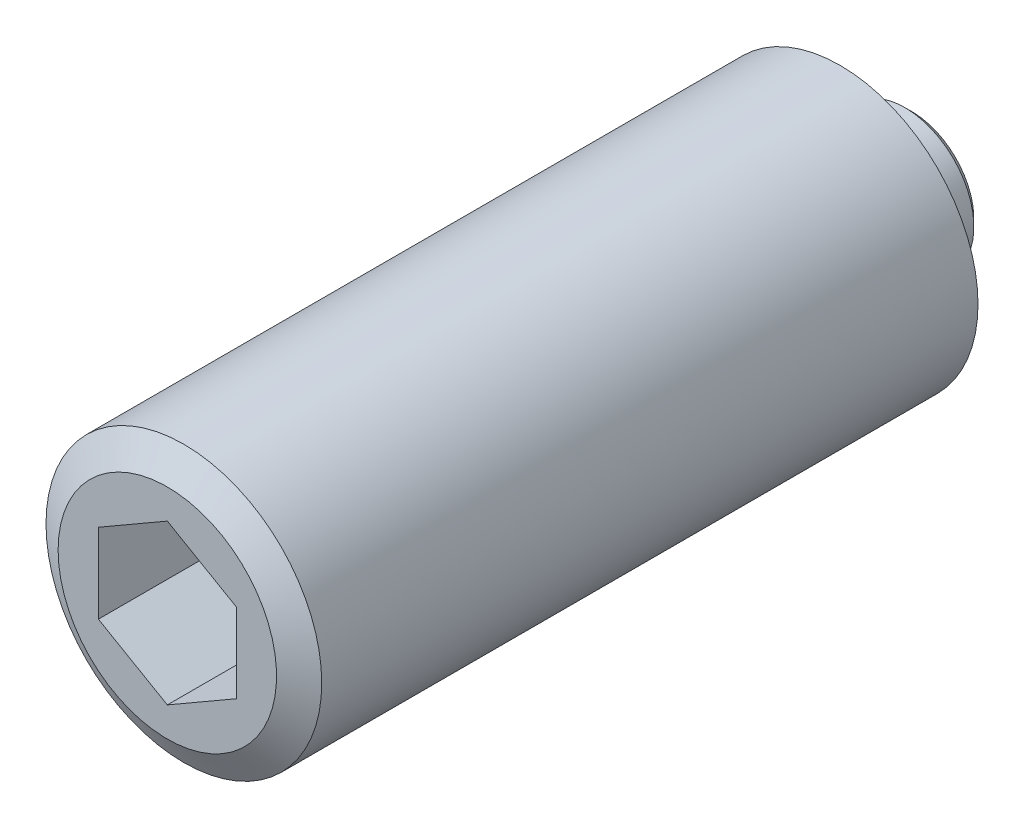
ISO-10303-21;
HEADER;
FILE_DESCRIPTION(('STEP AP214'),'2;1');
FILE_NAME('part.step','',(''),(''),'','','');
FILE_SCHEMA(('AUTOMOTIVE_DESIGN { 1 0 10303 214 1 1 1 1 }'));
ENDSEC;
DATA;
#1=APPLICATION_CONTEXT('core data for automotive mechanical design processes');
#2=APPLICATION_PROTOCOL_DEFINITION('international standard','automotive_design',2000,#1);
#3=PRODUCT_CONTEXT('',#1,'mechanical');
#4=PRODUCT('Part','Part','',(#3));
#5=PRODUCT_RELATED_PRODUCT_CATEGORY('part','',(#4));
#6=PRODUCT_DEFINITION_FORMATION('','',#4);
#7=PRODUCT_DEFINITION_CONTEXT('part definition',#1,'design');
#8=PRODUCT_DEFINITION('design','',#6,#7);
#9=PRODUCT_DEFINITION_SHAPE('','',#8);
#10=(LENGTH_UNIT() NAMED_UNIT(*) SI_UNIT(.MILLI.,.METRE.));
#11=(NAMED_UNIT(*) PLANE_ANGLE_UNIT() SI_UNIT($,.RADIAN.));
#12=(NAMED_UNIT(*) SI_UNIT($,.STERADIAN.) SOLID_ANGLE_UNIT());
#13=UNCERTAINTY_MEASURE_WITH_UNIT(LENGTH_MEASURE(1.E-05),#10,'distance_accuracy_value','');
#14=(GEOMETRIC_REPRESENTATION_CONTEXT(3) GLOBAL_UNCERTAINTY_ASSIGNED_CONTEXT((#13)) GLOBAL_UNIT_ASSIGNED_CONTEXT((#10,
#11,#12)) REPRESENTATION_CONTEXT('',''));
#15=CARTESIAN_POINT('',(0.,0.,0.));
#16=DIRECTION('',(0.,0.,1.));
#17=DIRECTION('',(1.,0.,0.));
#18=AXIS2_PLACEMENT_3D('',#15,#16,#17);
#19=CARTESIAN_POINT('',(0.,0.,0.));
#20=DIRECTION('',(0.,0.,-1.));
#21=DIRECTION('',(-1.,0.,0.));
#22=AXIS2_PLACEMENT_3D('',#19,#20,#21);
#23=PLANE('',#22);
#24=CARTESIAN_POINT('',(0.,0.,0.));
#25=DIRECTION('',(0.,0.,-1.));
#26=DIRECTION('',(-1.,0.,0.));
#27=AXIS2_PLACEMENT_3D('',#24,#25,#26);
#28=CIRCLE('',#27,4.5);
#29=CARTESIAN_POINT('',(-4.5,0.,0.));
#30=VERTEX_POINT('',#29);
#31=EDGE_CURVE('E9',#30,#30,#28,.T.);
#32=ORIENTED_EDGE('',*,*,#31,.T.);
#33=EDGE_LOOP('',(#32));
#34=FACE_BOUND('',#33,.T.);
#35=ADVANCED_FACE('F14',(#34),#23,.T.);
#36=CARTESIAN_POINT('',(0.,0.,0.));
#37=DIRECTION('',(0.,0.,1.));
#38=DIRECTION('',(1.,0.,0.));
#39=AXIS2_PLACEMENT_3D('',#36,#37,#38);
#40=CONICAL_SURFACE('',#39,4.5,0.785398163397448);
#41=CARTESIAN_POINT('',(0.,0.,0.5));
#42=DIRECTION('',(0.,0.,-1.));
#43=DIRECTION('',(-1.,0.,0.));
#44=AXIS2_PLACEMENT_3D('',#41,#42,#43);
#45=CIRCLE('',#44,5.);
#46=CARTESIAN_POINT('',(-5.,0.,0.5));
#47=VERTEX_POINT('',#46);
#48=EDGE_CURVE('E21',#47,#47,#45,.T.);
#49=ORIENTED_EDGE('',*,*,#48,.T.);
#50=EDGE_LOOP('',(#49));
#51=FACE_BOUND('',#50,.T.);
#52=ORIENTED_EDGE('',*,*,#31,.F.);
#53=EDGE_LOOP('',(#52));
#54=FACE_BOUND('',#53,.T.);
#55=ADVANCED_FACE('F143',(#51,#54),#40,.T.);
#56=CARTESIAN_POINT('',(0.,0.,-3.0000000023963));
#57=DIRECTION('',(0.,0.,-1.));
#58=DIRECTION('',(-1.,0.,0.));
#59=AXIS2_PLACEMENT_3D('',#56,#57,#58);
#60=CYLINDRICAL_SURFACE('',#59,5.);
#61=CARTESIAN_POINT('',(0.,0.,2.5));
#62=DIRECTION('',(0.,0.,-1.));
#63=DIRECTION('',(-1.,0.,0.));
#64=AXIS2_PLACEMENT_3D('',#61,#62,#63);
#65=CIRCLE('',#64,5.);
#66=CARTESIAN_POINT('',(-5.,0.,2.5));
#67=VERTEX_POINT('',#66);
#68=EDGE_CURVE('E138',#67,#67,#65,.T.);
#69=ORIENTED_EDGE('',*,*,#68,.T.);
#70=EDGE_LOOP('',(#69));
#71=FACE_BOUND('',#70,.T.);
#72=ORIENTED_EDGE('',*,*,#48,.F.);
#73=EDGE_LOOP('',(#72));
#74=FACE_BOUND('',#73,.T.);
#75=ADVANCED_FACE('F146',(#71,#74),#60,.T.);
#76=CARTESIAN_POINT('',(0.,5.19999997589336,2.5));
#77=DIRECTION('',(0.,0.,-1.));
#78=DIRECTION('',(-1.,0.,0.));
#79=AXIS2_PLACEMENT_3D('',#76,#77,#78);
#80=PLANE('',#79);
#81=CARTESIAN_POINT('',(0.,0.,2.5));
#82=DIRECTION('',(0.,0.,-1.));
#83=DIRECTION('',(-1.,0.,0.));
#84=AXIS2_PLACEMENT_3D('',#81,#82,#83);
#85=CIRCLE('',#84,5.19999997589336);
#86=CARTESIAN_POINT('',(0.,5.19999997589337,2.5));
#87=VERTEX_POINT('',#86);
#88=EDGE_CURVE('E135',#87,#87,#85,.T.);
#89=ORIENTED_EDGE('',*,*,#88,.T.);
#90=EDGE_LOOP('',(#89));
#91=FACE_BOUND('',#90,.T.);
#92=ORIENTED_EDGE('',*,*,#68,.F.);
#93=EDGE_LOOP('',(#92));
#94=FACE_BOUND('',#93,.T.);
#95=ADVANCED_FACE('F148',(#91,#94),#80,.T.);
#96=CARTESIAN_POINT('',(0.,0.,6.4));
#97=DIRECTION('',(0.,0.,-1.));
#98=DIRECTION('',(0.,1.,0.));
#99=AXIS2_PLACEMENT_3D('',#96,#97,#98);
#100=SPHERICAL_SURFACE('',#99,6.4999999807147);
#101=CARTESIAN_POINT('',(0.,0.,3.9999999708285));
#102=DIRECTION('',(0.,0.,-1.));
#103=DIRECTION('',(-1.,0.,0.));
#104=AXIS2_PLACEMENT_3D('',#101,#102,#103);
#105=CIRCLE('',#104,6.04069529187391);
#106=CARTESIAN_POINT('',(0.,6.04069529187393,3.9999999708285));
#107=VERTEX_POINT('',#106);
#108=EDGE_CURVE('E132',#107,#107,#105,.T.);
#109=CARTESIAN_POINT('',(0.,6.04069529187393,3.9999999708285));
#110=CARTESIAN_POINT('',(0.,6.0340622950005,3.9833050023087));
#111=CARTESIAN_POINT('',(0.,6.02736008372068,3.96663753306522));
#112=CARTESIAN_POINT('',(0.,6.01381770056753,3.93335873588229));
#113=CARTESIAN_POINT('',(0.,6.00697752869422,3.91674740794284));
#114=CARTESIAN_POINT('',(0.,5.99315969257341,3.88358203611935));
#115=CARTESIAN_POINT('',(0.,5.98618202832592,3.86702799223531));
#116=CARTESIAN_POINT('',(0.,5.97208968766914,3.83397832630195));
#117=CARTESIAN_POINT('',(0.,5.96497501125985,3.81748270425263));
#118=CARTESIAN_POINT('',(0.,5.95060913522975,3.78455101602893));
#119=CARTESIAN_POINT('',(0.,5.94335793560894,3.76811494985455));
#120=CARTESIAN_POINT('',(0.,5.92871951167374,3.73530350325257));
#121=CARTESIAN_POINT('',(0.,5.92133228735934,3.71892812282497));
#122=CARTESIAN_POINT('',(0.,5.90642232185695,3.68623917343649));
#123=CARTESIAN_POINT('',(0.,5.89889958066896,3.66992560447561));
#124=CARTESIAN_POINT('',(0.,5.88371909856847,3.63736139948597));
#125=CARTESIAN_POINT('',(0.,5.87606135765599,3.62111076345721));
#126=CARTESIAN_POINT('',(0.,5.86061140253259,3.58867354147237));
#127=CARTESIAN_POINT('',(0.,5.85281918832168,3.57248695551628));
#128=CARTESIAN_POINT('',(0.,5.83710082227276,3.54017894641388));
#129=CARTESIAN_POINT('',(0.,5.82917467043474,3.52405752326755));
#130=CARTESIAN_POINT('',(0.,5.81318897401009,3.49188094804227));
#131=CARTESIAN_POINT('',(0.,5.80512942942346,3.47582579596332));
#132=CARTESIAN_POINT('',(0.,5.78887750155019,3.44378286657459));
#133=CARTESIAN_POINT('',(0.,5.78068511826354,3.42779508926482));
#134=CARTESIAN_POINT('',(0.,5.76416807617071,3.39588800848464));
#135=CARTESIAN_POINT('',(0.,5.75584341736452,3.37996870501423));
#136=CARTESIAN_POINT('',(0.,5.7390623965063,3.34819966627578));
#137=CARTESIAN_POINT('',(0.,5.73060603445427,3.33234993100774));
#138=CARTESIAN_POINT('',(0.,5.7135621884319,3.30072111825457));
#139=CARTESIAN_POINT('',(0.,5.70497470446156,3.28494204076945));
#140=CARTESIAN_POINT('',(0.,5.68766920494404,3.25345562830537));
#141=CARTESIAN_POINT('',(0.,5.67895118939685,3.23774829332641));
#142=CARTESIAN_POINT('',(0.,5.66138522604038,3.206406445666));
#143=CARTESIAN_POINT('',(0.,5.6525372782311,3.19077193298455));
#144=CARTESIAN_POINT('',(0.,5.63471205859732,3.15957680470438));
#145=CARTESIAN_POINT('',(0.,5.62573478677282,3.14401618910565));
#146=CARTESIAN_POINT('',(0.,5.60765153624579,3.11296992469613));
#147=CARTESIAN_POINT('',(0.,5.59854555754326,3.09748427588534));
#148=CARTESIAN_POINT('',(0.,5.58020551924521,3.06658900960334));
#149=CARTESIAN_POINT('',(0.,5.5709714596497,3.05117939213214));
#150=CARTESIAN_POINT('',(0.,5.55237589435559,3.02043724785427));
#151=CARTESIAN_POINT('',(0.,5.543014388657,3.00510472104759));
#152=CARTESIAN_POINT('',(0.,5.52416457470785,2.97451781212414));
#153=CARTESIAN_POINT('',(0.,5.51467626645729,2.95926343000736));
#154=CARTESIAN_POINT('',(0.,5.49557349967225,2.9288338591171));
#155=CARTESIAN_POINT('',(0.,5.48595904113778,2.9136586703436));
#156=CARTESIAN_POINT('',(0.,5.46660463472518,2.88338852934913));
#157=CARTESIAN_POINT('',(0.,5.45686468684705,2.86829357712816));
#158=CARTESIAN_POINT('',(0.,5.43725997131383,2.83818494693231));
#159=CARTESIAN_POINT('',(0.,5.42739520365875,2.82317126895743));
#160=CARTESIAN_POINT('',(0.,5.40754152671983,2.79322621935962));
#161=CARTESIAN_POINT('',(0.,5.39755261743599,2.77829484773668));
#162=CARTESIAN_POINT('',(0.,5.37745134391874,2.74851543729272));
#163=CARTESIAN_POINT('',(0.,5.36733897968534,2.7336673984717));
#164=CARTESIAN_POINT('',(0.,5.34699149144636,2.70405567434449));
#165=CARTESIAN_POINT('',(0.,5.33675636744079,2.68929198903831));
#166=CARTESIAN_POINT('',(0.,5.31616406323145,2.65984998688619));
#167=CARTESIAN_POINT('',(0.,5.30580688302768,2.64517167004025));
#168=CARTESIAN_POINT('',(0.,5.28497117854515,2.61590141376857));
#169=CARTESIAN_POINT('',(0.,5.2744926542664,2.60130947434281));
#170=CARTESIAN_POINT('',(0.,5.25341498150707,2.57221297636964));
#171=CARTESIAN_POINT('',(0.,5.24281583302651,2.55770841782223));
#172=CARTESIAN_POINT('',(0.,5.22149764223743,2.52878767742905));
#173=CARTESIAN_POINT('',(0.,5.21077859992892,2.51437149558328));
#174=CARTESIAN_POINT('',(0.,5.19999997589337,2.5));
#175=B_SPLINE_CURVE_WITH_KNOTS('',3,(#109,#110,#111,#112,#113,#114,#115,#116,#117,#118,#119,
#120,#121,#122,#123,#124,#125,#126,#127,#128,#129,#130,#131,#132,#133,#134,#135,#136,#137,#138,
#139,#140,#141,#142,#143,#144,#145,#146,#147,#148,#149,#150,#151,#152,#153,#154,#155,#156,#157,
#158,#159,#160,#161,#162,#163,#164,#165,#166,#167,#168,#169,#170,#171,#172,#173,#174),
.UNSPECIFIED.,.F.,.F.,(4,2,2,2,2,2,2,2,2,2,2,2,2,2,2,2,2,2,2,2,2,2,2,2,2,2,2,2,2,2,2,2,4),(0.,
0.0538929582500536,0.107785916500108,0.161678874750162,0.215571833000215,0.26946479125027,
0.323357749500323,0.377250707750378,0.431143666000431,0.485036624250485,0.538929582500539,
0.592822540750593,0.646715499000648,0.700608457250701,0.754501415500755,0.808394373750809,
0.862287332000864,0.916180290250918,0.970073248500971,1.02396620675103,1.07785916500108,
1.13175212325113,1.18564508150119,1.23953803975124,1.2934309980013,1.34732395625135,
1.4012169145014,1.45510987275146,1.50900283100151,1.56289578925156,1.61678874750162,
1.67068170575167,1.72457466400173),.UNSPECIFIED.);
#176=EDGE_CURVE('BSEAM157',#107,#87,#175,.T.);
#177=ORIENTED_EDGE('',*,*,#108,.T.);
#178=ORIENTED_EDGE('',*,*,#88,.F.);
#179=ORIENTED_EDGE('',*,*,#176,.T.);
#180=ORIENTED_EDGE('',*,*,#176,.F.);
#181=EDGE_LOOP('',(#177,#179,#178,#180));
#182=FACE_BOUND('',#181,.T.);
#183=ADVANCED_FACE('F157',(#182),#100,.T.);
#184=CARTESIAN_POINT('',(0.,7.92153901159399,3.9999999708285));
#185=DIRECTION('',(0.,0.,-1.));
#186=DIRECTION('',(-1.,0.,0.));
#187=AXIS2_PLACEMENT_3D('',#184,#185,#186);
#188=PLANE('',#187);
#189=CARTESIAN_POINT('',(0.,0.,3.9999999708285));
#190=DIRECTION('',(0.,0.,-1.));
#191=DIRECTION('',(-1.,0.,0.));
#192=AXIS2_PLACEMENT_3D('',#189,#190,#191);
#193=CIRCLE('',#192,7.92153901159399);
#194=CARTESIAN_POINT('',(-7.92153901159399,0.,3.9999999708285));
#195=VERTEX_POINT('',#194);
#196=EDGE_CURVE('E129',#195,#195,#193,.T.);
#197=ORIENTED_EDGE('',*,*,#196,.T.);
#198=EDGE_LOOP('',(#197));
#199=FACE_BOUND('',#198,.T.);
#200=ORIENTED_EDGE('',*,*,#108,.F.);
#201=EDGE_LOOP('',(#200));
#202=FACE_BOUND('',#201,.T.);
#203=ADVANCED_FACE('F196',(#199,#202),#188,.T.);
#204=CARTESIAN_POINT('',(0.,0.,3.9999999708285));
#205=DIRECTION('',(0.,0.,1.));
#206=DIRECTION('',(1.,0.,0.));
#207=AXIS2_PLACEMENT_3D('',#204,#205,#206);
#208=CONICAL_SURFACE('',#207,7.92153901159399,1.0471975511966);
#209=CARTESIAN_POINT('',(0.,0.,5.1999999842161));
#210=DIRECTION('',(0.,0.,-1.));
#211=DIRECTION('',(-1.,0.,0.));
#212=AXIS2_PLACEMENT_3D('',#209,#210,#211);
#213=CIRCLE('',#212,10.0000000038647);
#214=CARTESIAN_POINT('',(-10.0000000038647,0.,5.1999999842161));
#215=VERTEX_POINT('',#214);
#216=EDGE_CURVE('E126',#215,#215,#213,.T.);
#217=ORIENTED_EDGE('',*,*,#216,.T.);
#218=EDGE_LOOP('',(#217));
#219=FACE_BOUND('',#218,.T.);
#220=ORIENTED_EDGE('',*,*,#196,.F.);
#221=EDGE_LOOP('',(#220));
#222=FACE_BOUND('',#221,.T.);
#223=ADVANCED_FACE('F204',(#219,#222),#208,.T.);
#224=CARTESIAN_POINT('',(0.,0.,-3.0000000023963));
#225=DIRECTION('',(0.,0.,-1.));
#226=DIRECTION('',(-1.,0.,0.));
#227=AXIS2_PLACEMENT_3D('',#224,#225,#226);
#228=CYLINDRICAL_SURFACE('',#227,10.0000000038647);
#229=CARTESIAN_POINT('',(0.,0.,52.7999999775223));
#230=DIRECTION('',(0.,0.,-1.));
#231=DIRECTION('',(-1.,0.,0.));
#232=AXIS2_PLACEMENT_3D('',#229,#230,#231);
#233=CIRCLE('',#232,10.0000000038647);
#234=CARTESIAN_POINT('',(-10.0000000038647,0.,52.7999999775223));
#235=VERTEX_POINT('',#234);
#236=EDGE_CURVE('E123',#235,#235,#233,.T.);
#237=ORIENTED_EDGE('',*,*,#236,.T.);
#238=EDGE_LOOP('',(#237));
#239=FACE_BOUND('',#238,.T.);
#240=ORIENTED_EDGE('',*,*,#216,.F.);
#241=EDGE_LOOP('',(#240));
#242=FACE_BOUND('',#241,.T.);
#243=ADVANCED_FACE('F213',(#239,#242),#228,.T.);
#244=CARTESIAN_POINT('',(0.,0.,52.7999999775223));
#245=DIRECTION('',(0.,0.,-1.));
#246=DIRECTION('',(-1.,0.,0.));
#247=AXIS2_PLACEMENT_3D('',#244,#245,#246);
#248=CONICAL_SURFACE('',#247,10.0000000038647,1.0471975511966);
#249=CARTESIAN_POINT('',(0.,0.,53.9999999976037));
#250=DIRECTION('',(0.,0.,-1.));
#251=DIRECTION('',(-1.,0.,0.));
#252=AXIS2_PLACEMENT_3D('',#249,#250,#251);
#253=CIRCLE('',#252,7.921539);
#254=CARTESIAN_POINT('',(-7.921539,0.,53.9999999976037));
#255=VERTEX_POINT('',#254);
#256=EDGE_CURVE('E115',#255,#255,#253,.T.);
#257=ORIENTED_EDGE('',*,*,#256,.T.);
#258=EDGE_LOOP('',(#257));
#259=FACE_BOUND('',#258,.T.);
#260=ORIENTED_EDGE('',*,*,#236,.F.);
#261=EDGE_LOOP('',(#260));
#262=FACE_BOUND('',#261,.T.);
#263=ADVANCED_FACE('F222',(#259,#262),#248,.T.);
#264=CARTESIAN_POINT('',(0.,7.921539,53.9999999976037));
#265=DIRECTION('',(0.,0.,1.));
#266=DIRECTION('',(1.,0.,0.));
#267=AXIS2_PLACEMENT_3D('',#264,#265,#266);
#268=PLANE('',#267);
#269=DIRECTION('',(-0.866025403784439,0.5,0.));
#270=VECTOR('',#269,1.);
#271=CARTESIAN_POINT('',(5.,2.88675134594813,53.9999999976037));
#272=LINE('',#271,#270);
#273=CARTESIAN_POINT('',(5.,2.88675134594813,53.9999999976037));
#274=VERTEX_POINT('',#273);
#275=CARTESIAN_POINT('',(0.,5.77350269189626,53.9999999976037));
#276=VERTEX_POINT('',#275);
#277=EDGE_CURVE('E28',#274,#276,#272,.T.);
#278=ORIENTED_EDGE('',*,*,#277,.F.);
#279=DIRECTION('',(0.,1.,0.));
#280=VECTOR('',#279,1.);
#281=CARTESIAN_POINT('',(5.,-2.88675134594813,53.9999999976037));
#282=LINE('',#281,#280);
#283=CARTESIAN_POINT('',(5.,-2.88675134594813,53.9999999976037));
#284=VERTEX_POINT('',#283);
#285=EDGE_CURVE('E111',#284,#274,#282,.T.);
#286=ORIENTED_EDGE('',*,*,#285,.F.);
#287=DIRECTION('',(0.866025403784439,0.5,0.));
#288=VECTOR('',#287,1.);
#289=CARTESIAN_POINT('',(0.,-5.77350269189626,53.9999999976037));
#290=LINE('',#289,#288);
#291=CARTESIAN_POINT('',(0.,-5.77350269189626,53.9999999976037));
#292=VERTEX_POINT('',#291);
#293=EDGE_CURVE('E109',#292,#284,#290,.T.);
#294=ORIENTED_EDGE('',*,*,#293,.F.);
#295=DIRECTION('',(0.866025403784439,-0.5,0.));
#296=VECTOR('',#295,1.);
#297=CARTESIAN_POINT('',(-5.,-2.88675134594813,53.9999999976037));
#298=LINE('',#297,#296);
#299=CARTESIAN_POINT('',(-5.,-2.88675134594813,53.9999999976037));
#300=VERTEX_POINT('',#299);
#301=EDGE_CURVE('E76',#300,#292,#298,.T.);
#302=ORIENTED_EDGE('',*,*,#301,.F.);
#303=DIRECTION('',(0.,-1.,0.));
#304=VECTOR('',#303,1.);
#305=CARTESIAN_POINT('',(-5.,2.88675134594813,53.9999999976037));
#306=LINE('',#305,#304);
#307=CARTESIAN_POINT('',(-5.,2.88675134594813,53.9999999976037));
#308=VERTEX_POINT('',#307);
#309=EDGE_CURVE('E105',#308,#300,#306,.T.);
#310=ORIENTED_EDGE('',*,*,#309,.F.);
#311=DIRECTION('',(-0.866025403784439,-0.5,0.));
#312=VECTOR('',#311,1.);
#313=CARTESIAN_POINT('',(0.,5.77350269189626,53.9999999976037));
#314=LINE('',#313,#312);
#315=EDGE_CURVE('E102',#276,#308,#314,.T.);
#316=ORIENTED_EDGE('',*,*,#315,.F.);
#317=EDGE_LOOP('',(#278,#286,#294,#302,#310,#316));
#318=FACE_BOUND('',#317,.T.);
#319=ORIENTED_EDGE('',*,*,#256,.F.);
#320=EDGE_LOOP('',(#319));
#321=FACE_BOUND('',#320,.T.);
#322=ADVANCED_FACE('F231',(#318,#321),#268,.T.);
#323=CARTESIAN_POINT('',(5.,2.88675134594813,45.9999999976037));
#324=DIRECTION('',(0.5,0.866025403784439,0.));
#325=DIRECTION('',(-0.866025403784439,0.5,0.));
#326=AXIS2_PLACEMENT_3D('',#323,#324,#325);
#327=PLANE('',#326);
#328=ORIENTED_EDGE('',*,*,#277,.T.);
#329=DIRECTION('',(0.,0.,1.));
#330=VECTOR('',#329,1.);
#331=CARTESIAN_POINT('',(0.,5.77350269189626,45.9999999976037));
#332=LINE('',#331,#330);
#333=CARTESIAN_POINT('',(0.,5.77350269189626,45.9999999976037));
#334=VERTEX_POINT('',#333);
#335=EDGE_CURVE('E58',#334,#276,#332,.T.);
#336=ORIENTED_EDGE('',*,*,#335,.F.);
#337=DIRECTION('',(-0.866025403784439,0.5,0.));
#338=VECTOR('',#337,1.);
#339=CARTESIAN_POINT('',(5.,2.88675134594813,45.9999999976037));
#340=LINE('',#339,#338);
#341=CARTESIAN_POINT('',(5.,2.88675134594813,45.9999999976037));
#342=VERTEX_POINT('',#341);
#343=EDGE_CURVE('E113',#342,#334,#340,.T.);
#344=ORIENTED_EDGE('',*,*,#343,.F.);
#345=DIRECTION('',(0.,0.,1.));
#346=VECTOR('',#345,1.);
#347=CARTESIAN_POINT('',(5.,2.88675134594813,45.9999999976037));
#348=LINE('',#347,#346);
#349=EDGE_CURVE('E36',#342,#274,#348,.T.);
#350=ORIENTED_EDGE('',*,*,#349,.T.);
#351=EDGE_LOOP('',(#328,#336,#344,#350));
#352=FACE_BOUND('',#351,.T.);
#353=ADVANCED_FACE('F240',(#352),#327,.F.);
#354=CARTESIAN_POINT('',(5.,-2.88675134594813,45.9999999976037));
#355=DIRECTION('',(1.,0.,0.));
#356=DIRECTION('',(0.,0.,-1.));
#357=AXIS2_PLACEMENT_3D('',#354,#355,#356);
#358=PLANE('',#357);
#359=ORIENTED_EDGE('',*,*,#285,.T.);
#360=ORIENTED_EDGE('',*,*,#349,.F.);
#361=DIRECTION('',(0.,1.,0.));
#362=VECTOR('',#361,1.);
#363=CARTESIAN_POINT('',(5.,-2.88675134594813,45.9999999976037));
#364=LINE('',#363,#362);
#365=CARTESIAN_POINT('',(5.,-2.88675134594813,45.9999999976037));
#366=VERTEX_POINT('',#365);
#367=EDGE_CURVE('E88',#366,#342,#364,.T.);
#368=ORIENTED_EDGE('',*,*,#367,.F.);
#369=DIRECTION('',(0.,0.,1.));
#370=VECTOR('',#369,1.);
#371=CARTESIAN_POINT('',(5.,-2.88675134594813,45.9999999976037));
#372=LINE('',#371,#370);
#373=EDGE_CURVE('E80',#366,#284,#372,.T.);
#374=ORIENTED_EDGE('',*,*,#373,.T.);
#375=EDGE_LOOP('',(#359,#360,#368,#374));
#376=FACE_BOUND('',#375,.T.);
#377=ADVANCED_FACE('F249',(#376),#358,.F.);
#378=CARTESIAN_POINT('',(0.,-5.77350269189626,45.9999999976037));
#379=DIRECTION('',(0.5,-0.866025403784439,0.));
#380=DIRECTION('',(0.866025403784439,0.5,0.));
#381=AXIS2_PLACEMENT_3D('',#378,#379,#380);
#382=PLANE('',#381);
#383=ORIENTED_EDGE('',*,*,#293,.T.);
#384=ORIENTED_EDGE('',*,*,#373,.F.);
#385=DIRECTION('',(0.866025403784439,0.5,0.));
#386=VECTOR('',#385,1.);
#387=CARTESIAN_POINT('',(0.,-5.77350269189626,45.9999999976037));
#388=LINE('',#387,#386);
#389=CARTESIAN_POINT('',(0.,-5.77350269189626,45.9999999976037));
#390=VERTEX_POINT('',#389);
#391=EDGE_CURVE('E84',#390,#366,#388,.T.);
#392=ORIENTED_EDGE('',*,*,#391,.F.);
#393=DIRECTION('',(0.,0.,1.));
#394=VECTOR('',#393,1.);
#395=CARTESIAN_POINT('',(0.,-5.77350269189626,45.9999999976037));
#396=LINE('',#395,#394);
#397=EDGE_CURVE('E69',#390,#292,#396,.T.);
#398=ORIENTED_EDGE('',*,*,#397,.T.);
#399=EDGE_LOOP('',(#383,#384,#392,#398));
#400=FACE_BOUND('',#399,.T.);
#401=ADVANCED_FACE('F85',(#400),#382,.F.);
#402=CARTESIAN_POINT('',(-5.,-2.88675134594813,45.9999999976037));
#403=DIRECTION('',(-0.5,-0.866025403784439,0.));
#404=DIRECTION('',(0.866025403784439,-0.5,0.));
#405=AXIS2_PLACEMENT_3D('',#402,#403,#404);
#406=PLANE('',#405);
#407=ORIENTED_EDGE('',*,*,#301,.T.);
#408=ORIENTED_EDGE('',*,*,#397,.F.);
#409=DIRECTION('',(0.866025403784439,-0.5,0.));
#410=VECTOR('',#409,1.);
#411=CARTESIAN_POINT('',(-5.,-2.88675134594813,45.9999999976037));
#412=LINE('',#411,#410);
#413=CARTESIAN_POINT('',(-5.,-2.88675134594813,45.9999999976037));
#414=VERTEX_POINT('',#413);
#415=EDGE_CURVE('E73',#414,#390,#412,.T.);
#416=ORIENTED_EDGE('',*,*,#415,.F.);
#417=DIRECTION('',(0.,0.,1.));
#418=VECTOR('',#417,1.);
#419=CARTESIAN_POINT('',(-5.,-2.88675134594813,45.9999999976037));
#420=LINE('',#419,#418);
#421=EDGE_CURVE('E81',#414,#300,#420,.T.);
#422=ORIENTED_EDGE('',*,*,#421,.T.);
#423=EDGE_LOOP('',(#407,#408,#416,#422));
#424=FACE_BOUND('',#423,.T.);
#425=ADVANCED_FACE('F71',(#424),#406,.F.);
#426=CARTESIAN_POINT('',(-5.,2.88675134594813,45.9999999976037));
#427=DIRECTION('',(-1.,0.,0.));
#428=DIRECTION('',(0.,0.,1.));
#429=AXIS2_PLACEMENT_3D('',#426,#427,#428);
#430=PLANE('',#429);
#431=ORIENTED_EDGE('',*,*,#309,.T.);
#432=ORIENTED_EDGE('',*,*,#421,.F.);
#433=DIRECTION('',(0.,-1.,0.));
#434=VECTOR('',#433,1.);
#435=CARTESIAN_POINT('',(-5.,2.88675134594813,45.9999999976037));
#436=LINE('',#435,#434);
#437=CARTESIAN_POINT('',(-5.,2.88675134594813,45.9999999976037));
#438=VERTEX_POINT('',#437);
#439=EDGE_CURVE('E94',#438,#414,#436,.T.);
#440=ORIENTED_EDGE('',*,*,#439,.F.);
#441=DIRECTION('',(0.,0.,1.));
#442=VECTOR('',#441,1.);
#443=CARTESIAN_POINT('',(-5.,2.88675134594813,45.9999999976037));
#444=LINE('',#443,#442);
#445=EDGE_CURVE('E118',#438,#308,#444,.T.);
#446=ORIENTED_EDGE('',*,*,#445,.T.);
#447=EDGE_LOOP('',(#431,#432,#440,#446));
#448=FACE_BOUND('',#447,.T.);
#449=ADVANCED_FACE('F271',(#448),#430,.F.);
#450=CARTESIAN_POINT('',(0.,5.77350269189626,45.9999999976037));
#451=DIRECTION('',(-0.5,0.866025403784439,0.));
#452=DIRECTION('',(-0.866025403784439,-0.5,0.));
#453=AXIS2_PLACEMENT_3D('',#450,#451,#452);
#454=PLANE('',#453);
#455=ORIENTED_EDGE('',*,*,#315,.T.);
#456=ORIENTED_EDGE('',*,*,#445,.F.);
#457=DIRECTION('',(-0.866025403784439,-0.5,0.));
#458=VECTOR('',#457,1.);
#459=CARTESIAN_POINT('',(0.,5.77350269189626,45.9999999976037));
#460=LINE('',#459,#458);
#461=EDGE_CURVE('E96',#334,#438,#460,.T.);
#462=ORIENTED_EDGE('',*,*,#461,.F.);
#463=ORIENTED_EDGE('',*,*,#335,.T.);
#464=EDGE_LOOP('',(#455,#456,#462,#463));
#465=FACE_BOUND('',#464,.T.);
#466=ADVANCED_FACE('F279',(#465),#454,.F.);
#467=CARTESIAN_POINT('',(0.,5.77350269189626,45.9999999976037));
#468=DIRECTION('',(0.,0.,1.));
#469=DIRECTION('',(1.,0.,0.));
#470=AXIS2_PLACEMENT_3D('',#467,#468,#469);
#471=PLANE('',#470);
#472=ORIENTED_EDGE('',*,*,#343,.T.);
#473=ORIENTED_EDGE('',*,*,#461,.T.);
#474=ORIENTED_EDGE('',*,*,#439,.T.);
#475=ORIENTED_EDGE('',*,*,#415,.T.);
#476=ORIENTED_EDGE('',*,*,#391,.T.);
#477=ORIENTED_EDGE('',*,*,#367,.T.);
#478=EDGE_LOOP('',(#472,#473,#474,#475,#476,#477));
#479=FACE_BOUND('',#478,.T.);
#480=ADVANCED_FACE('F91',(#479),#471,.T.);
#481=CLOSED_SHELL('',(#35,#55,#75,#95,#183,#203,#223,#243,#263,#322,#353,#377,#401,#425,#449,
#466,#480));
#482=MANIFOLD_SOLID_BREP('B1',#481);
#483=ADVANCED_BREP_SHAPE_REPRESENTATION('',(#18,#482),#14);
#484=SHAPE_DEFINITION_REPRESENTATION(#9,#483);
ENDSEC;
END-ISO-10303-21;
